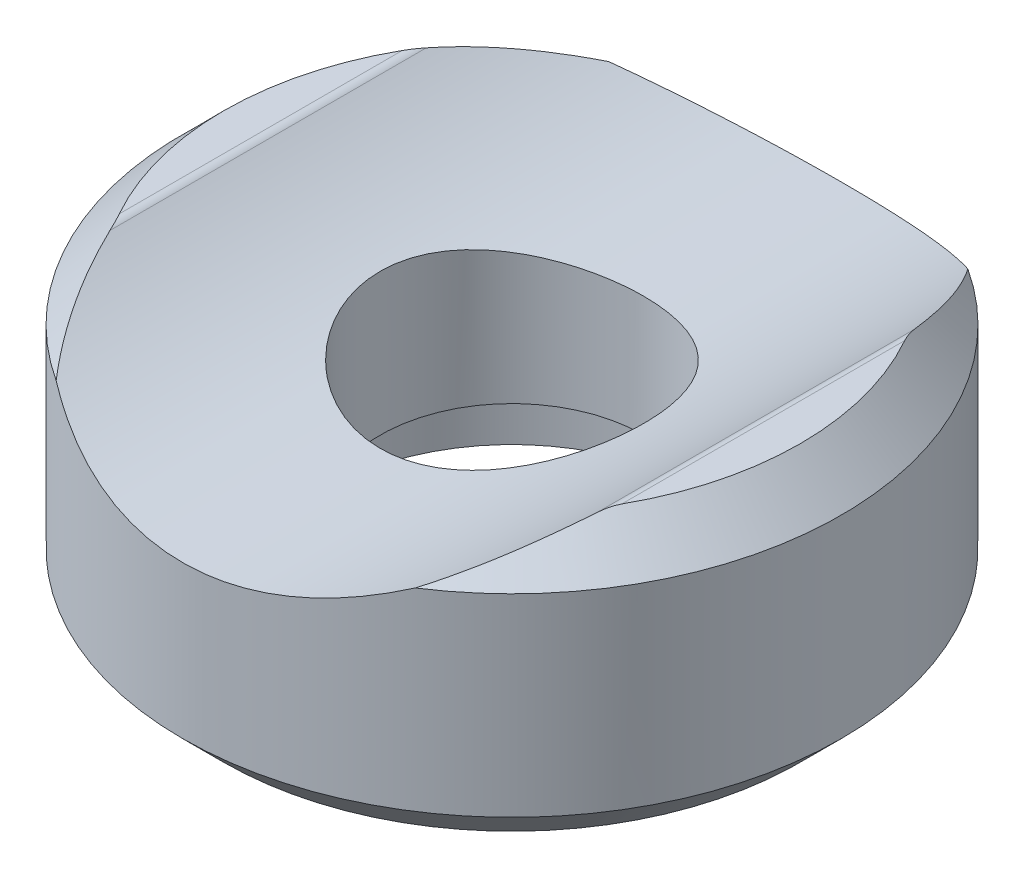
ISO-10303-21;
HEADER;
FILE_DESCRIPTION(('STEP AP214'),'2;1');
FILE_NAME('part.step','',(''),(''),'','','');
FILE_SCHEMA(('AUTOMOTIVE_DESIGN { 1 0 10303 214 1 1 1 1 }'));
ENDSEC;
DATA;
#1=APPLICATION_CONTEXT('core data for automotive mechanical design processes');
#2=APPLICATION_PROTOCOL_DEFINITION('international standard','automotive_design',2000,#1);
#3=PRODUCT_CONTEXT('',#1,'mechanical');
#4=PRODUCT('Part','Part','',(#3));
#5=PRODUCT_RELATED_PRODUCT_CATEGORY('part','',(#4));
#6=PRODUCT_DEFINITION_FORMATION('','',#4);
#7=PRODUCT_DEFINITION_CONTEXT('part definition',#1,'design');
#8=PRODUCT_DEFINITION('design','',#6,#7);
#9=PRODUCT_DEFINITION_SHAPE('','',#8);
#10=(LENGTH_UNIT() NAMED_UNIT(*) SI_UNIT(.MILLI.,.METRE.));
#11=(NAMED_UNIT(*) PLANE_ANGLE_UNIT() SI_UNIT($,.RADIAN.));
#12=(NAMED_UNIT(*) SI_UNIT($,.STERADIAN.) SOLID_ANGLE_UNIT());
#13=UNCERTAINTY_MEASURE_WITH_UNIT(LENGTH_MEASURE(1.E-05),#10,'distance_accuracy_value','');
#14=(GEOMETRIC_REPRESENTATION_CONTEXT(3) GLOBAL_UNCERTAINTY_ASSIGNED_CONTEXT((#13)) GLOBAL_UNIT_ASSIGNED_CONTEXT((#10,
#11,#12)) REPRESENTATION_CONTEXT('',''));
#15=CARTESIAN_POINT('',(0.,0.,0.));
#16=DIRECTION('',(0.,0.,1.));
#17=DIRECTION('',(1.,0.,0.));
#18=AXIS2_PLACEMENT_3D('',#15,#16,#17);
#19=CARTESIAN_POINT('',(0.,0.,0.));
#20=DIRECTION('',(0.,-1.,0.));
#21=DIRECTION('',(0.,0.,-1.));
#22=AXIS2_PLACEMENT_3D('',#19,#20,#21);
#23=CYLINDRICAL_SURFACE('',#22,3.2);
#24=CARTESIAN_POINT('',(-2.26416102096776,4.95969328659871,2.26132148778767));
#25=CARTESIAN_POINT('',(-2.39038548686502,4.98903348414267,2.13493706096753));
#26=CARTESIAN_POINT('',(-2.50600915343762,5.01850310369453,1.99797626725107));
#27=CARTESIAN_POINT('',(-2.7130495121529,5.07446639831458,1.70626814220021));
#28=CARTESIAN_POINT('',(-2.80446511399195,5.10095993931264,1.55152001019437));
#29=CARTESIAN_POINT('',(-2.9605367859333,5.14793687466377,1.22782400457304));
#30=CARTESIAN_POINT('',(-3.025143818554,5.16840923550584,1.05885078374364));
#31=CARTESIAN_POINT('',(-3.12507730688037,5.20070060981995,0.711680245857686));
#32=CARTESIAN_POINT('',(-3.16041430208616,5.21252273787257,0.533486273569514));
#33=CARTESIAN_POINT('',(-3.19974736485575,5.2257172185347,0.179523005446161));
#34=CARTESIAN_POINT('',(-3.20478164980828,5.22743568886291,0.0038818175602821));
#35=CARTESIAN_POINT('',(-3.18608523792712,5.22113110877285,-0.345671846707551));
#36=CARTESIAN_POINT('',(-3.16235679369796,5.21310882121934,-0.519584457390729));
#37=CARTESIAN_POINT('',(-3.08794127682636,5.18863398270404,-0.856565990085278));
#38=CARTESIAN_POINT('',(-3.03790076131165,5.17238394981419,-1.01979368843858));
#39=CARTESIAN_POINT('',(-2.91291355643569,5.1334334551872,-1.33558504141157));
#40=CARTESIAN_POINT('',(-2.837962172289,5.11073177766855,-1.48814667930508));
#41=CARTESIAN_POINT('',(-2.66217099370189,5.0604215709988,-1.78424876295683));
#42=CARTESIAN_POINT('',(-2.56050040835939,5.03266646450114,-1.92727067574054));
#43=CARTESIAN_POINT('',(-2.33535115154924,4.97582411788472,-2.19469942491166));
#44=CARTESIAN_POINT('',(-2.2118667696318,4.94673653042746,-2.31910137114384));
#45=CARTESIAN_POINT('',(-1.94071818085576,4.88911092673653,-2.55081502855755));
#46=CARTESIAN_POINT('',(-1.79228675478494,4.86064095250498,-2.65724861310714));
#47=CARTESIAN_POINT('',(-1.47883374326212,4.80867809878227,-2.84363955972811));
#48=CARTESIAN_POINT('',(-1.31381391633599,4.78518469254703,-2.92359972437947));
#49=CARTESIAN_POINT('',(-0.974231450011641,4.74612497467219,-3.05342762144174));
#50=CARTESIAN_POINT('',(-0.799844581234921,4.73044729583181,-3.10372011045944));
#51=CARTESIAN_POINT('',(-0.444531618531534,4.70830204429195,-3.17414002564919));
#52=CARTESIAN_POINT('',(-0.263607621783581,4.70183154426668,-3.19427703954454));
#53=CARTESIAN_POINT('',(0.0912435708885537,4.69890972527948,-3.20340621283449));
#54=CARTESIAN_POINT('',(0.265134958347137,4.70203719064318,-3.19370768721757));
#55=CARTESIAN_POINT('',(0.608665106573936,4.71706009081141,-3.14636119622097));
#56=CARTESIAN_POINT('',(0.778303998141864,4.72895525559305,-3.1087140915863));
#57=CARTESIAN_POINT('',(1.10749446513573,4.7601491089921,-3.00714769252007));
#58=CARTESIAN_POINT('',(1.26710663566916,4.77939705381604,-2.94340825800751));
#59=CARTESIAN_POINT('',(1.57351405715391,4.82335884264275,-2.79164833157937));
#60=CARTESIAN_POINT('',(1.72030668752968,4.84807380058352,-2.70362289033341));
#61=CARTESIAN_POINT('',(2.0030482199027,4.90156591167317,-2.50182346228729));
#62=CARTESIAN_POINT('',(2.13835675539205,4.93046334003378,-2.38718410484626));
#63=CARTESIAN_POINT('',(2.38823357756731,4.98852077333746,-2.13719209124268));
#64=CARTESIAN_POINT('',(2.50279662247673,5.01768084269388,-2.00183421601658));
#65=CARTESIAN_POINT('',(2.71138285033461,5.07397006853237,-1.70927887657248));
#66=CARTESIAN_POINT('',(2.80467888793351,5.10101097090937,-1.55154413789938));
#67=CARTESIAN_POINT('',(2.96326680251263,5.14877225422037,-1.22168548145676));
#68=CARTESIAN_POINT('',(3.02856528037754,5.16949412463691,-1.04956496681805));
#69=CARTESIAN_POINT('',(3.1275096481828,5.20150847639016,-0.700510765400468));
#70=CARTESIAN_POINT('',(3.16194142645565,5.21303420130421,-0.52382202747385));
#71=CARTESIAN_POINT('',(3.2006838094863,5.2260322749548,-0.166829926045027));
#72=CARTESIAN_POINT('',(3.20500400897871,5.22750782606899,0.0134722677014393));
#73=CARTESIAN_POINT('',(3.18385915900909,5.22038331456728,0.364005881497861));
#74=CARTESIAN_POINT('',(3.15971266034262,5.21222925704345,0.534328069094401));
#75=CARTESIAN_POINT('',(3.08468720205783,5.18757415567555,0.868337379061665));
#76=CARTESIAN_POINT('',(3.03380600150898,5.17107241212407,1.03202394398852));
#77=CARTESIAN_POINT('',(2.90642679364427,5.13145042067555,1.349915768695));
#78=CARTESIAN_POINT('',(2.82970596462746,5.10827286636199,1.504024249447));
#79=CARTESIAN_POINT('',(2.65297049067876,5.05789603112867,1.7975297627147));
#80=CARTESIAN_POINT('',(2.55294971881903,5.03069569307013,1.93692291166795));
#81=CARTESIAN_POINT('',(2.32679026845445,4.97373355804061,2.20411612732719));
#82=CARTESIAN_POINT('',(2.19962844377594,4.94391148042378,2.33103866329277));
#83=CARTESIAN_POINT('',(1.92561954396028,4.8861542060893,2.56205126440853));
#84=CARTESIAN_POINT('',(1.77877002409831,4.85821924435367,2.66613848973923));
#85=CARTESIAN_POINT('',(1.46678412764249,4.80687811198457,2.84987317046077));
#86=CARTESIAN_POINT('',(1.30141328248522,4.78354355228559,2.92914400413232));
#87=CARTESIAN_POINT('',(0.958770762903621,4.7445776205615,3.05847389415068));
#88=CARTESIAN_POINT('',(0.781502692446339,4.72894392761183,3.10854175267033));
#89=CARTESIAN_POINT('',(0.427256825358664,4.70761581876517,3.17627711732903));
#90=CARTESIAN_POINT('',(0.250520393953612,4.70156867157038,3.19509574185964));
#91=CARTESIAN_POINT('',(-0.103683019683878,4.6989703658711,3.20321956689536));
#92=CARTESIAN_POINT('',(-0.281149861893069,4.70241746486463,3.19253018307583));
#93=CARTESIAN_POINT('',(-0.62608659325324,4.71816942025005,3.14284274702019));
#94=CARTESIAN_POINT('',(-0.793696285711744,4.73020074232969,3.10471858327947));
#95=CARTESIAN_POINT('',(-1.12004492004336,4.76156993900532,3.00245708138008));
#96=CARTESIAN_POINT('',(-1.27878308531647,4.78090845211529,2.93831746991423));
#97=CARTESIAN_POINT('',(-1.58535989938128,4.82523670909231,2.78502856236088));
#98=CARTESIAN_POINT('',(-1.73303488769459,4.85029497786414,2.69557256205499));
#99=CARTESIAN_POINT('',(-2.01179236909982,4.90342626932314,2.49444370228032));
#100=CARTESIAN_POINT('',(-2.14287079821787,4.93150002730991,2.38276541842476));
#101=CARTESIAN_POINT('',(-2.26416102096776,4.95969328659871,2.26132148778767));
#102=B_SPLINE_CURVE_WITH_KNOTS('',3,(#24,#25,#26,#27,#28,#29,#30,#31,#32,#33,#34,#35,#36,#37,
#38,#39,#40,#41,#42,#43,#44,#45,#46,#47,#48,#49,#50,#51,#52,#53,#54,#55,#56,#57,#58,#59,#60,#61,
#62,#63,#64,#65,#66,#67,#68,#69,#70,#71,#72,#73,#74,#75,#76,#77,#78,#79,#80,#81,#82,#83,#84,#85,
#86,#87,#88,#89,#90,#91,#92,#93,#94,#95,#96,#97,#98,#99,#100,#101),.UNSPECIFIED.,.T.,.F.,(4,2,2,
2,2,2,2,2,2,2,2,2,2,2,2,2,2,2,2,2,2,2,2,2,2,2,2,2,2,2,2,2,2,2,2,2,2,2,4),(0.,0.542449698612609,
1.08492382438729,1.62838590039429,2.17165220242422,2.69619432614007,3.22069537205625,
3.73287203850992,4.24514528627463,4.77575907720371,5.30651197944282,5.85840610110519,
6.41024177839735,6.95397190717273,7.49752912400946,8.01757809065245,8.53761104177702,
9.05411809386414,9.57073048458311,10.1073558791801,10.6441166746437,11.1971336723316,
11.7500202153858,12.288393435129,12.826595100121,13.340816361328,13.8550807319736,
14.3738983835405,14.892852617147,15.4367145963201,15.9806441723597,16.5324678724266,
17.0841251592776,17.6149698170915,18.1457170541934,18.6602667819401,19.1748614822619,
19.6959789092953,20.2172236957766),.UNSPECIFIED.);
#103=CARTESIAN_POINT('',(-2.26416102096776,4.95969328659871,2.26132148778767));
#104=VERTEX_POINT('',#103);
#105=EDGE_CURVE('E87',#104,#104,#102,.F.);
#106=ORIENTED_EDGE('',*,*,#105,.T.);
#107=EDGE_LOOP('',(#106));
#108=FACE_BOUND('',#107,.T.);
#109=CARTESIAN_POINT('',(0.,1.78111880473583,0.));
#110=DIRECTION('',(0.,-1.,0.));
#111=DIRECTION('',(0.,0.,-1.));
#112=AXIS2_PLACEMENT_3D('',#109,#110,#111);
#113=CIRCLE('',#112,3.2);
#114=CARTESIAN_POINT('',(0.,1.78111880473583,-3.2));
#115=VERTEX_POINT('',#114);
#116=EDGE_CURVE('E171',#115,#115,#113,.T.);
#117=ORIENTED_EDGE('',*,*,#116,.T.);
#118=EDGE_LOOP('',(#117));
#119=FACE_BOUND('',#118,.T.);
#120=ADVANCED_FACE('F14',(#108,#119),#23,.F.);
#121=CARTESIAN_POINT('',(0.,0.999999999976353,0.));
#122=DIRECTION('',(0.,-1.,0.));
#123=DIRECTION('',(0.,0.,-1.));
#124=AXIS2_PLACEMENT_3D('',#121,#122,#123);
#125=CONICAL_SURFACE('',#124,4.50000000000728,1.02974425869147);
#126=ORIENTED_EDGE('',*,*,#116,.F.);
#127=EDGE_LOOP('',(#126));
#128=FACE_BOUND('',#127,.T.);
#129=CARTESIAN_POINT('',(0.,1.,0.));
#130=DIRECTION('',(0.,-1.,0.));
#131=DIRECTION('',(0.,0.,-1.));
#132=AXIS2_PLACEMENT_3D('',#129,#130,#131);
#133=CIRCLE('',#132,4.5);
#134=CARTESIAN_POINT('',(0.,1.,-4.5));
#135=VERTEX_POINT('',#134);
#136=EDGE_CURVE('E169',#135,#135,#133,.T.);
#137=ORIENTED_EDGE('',*,*,#136,.T.);
#138=EDGE_LOOP('',(#137));
#139=FACE_BOUND('',#138,.T.);
#140=ADVANCED_FACE('F227',(#128,#139),#125,.F.);
#141=CARTESIAN_POINT('',(0.,0.,0.));
#142=DIRECTION('',(0.,-1.,0.));
#143=DIRECTION('',(0.,0.,-1.));
#144=AXIS2_PLACEMENT_3D('',#141,#142,#143);
#145=CYLINDRICAL_SURFACE('',#144,4.5);
#146=ORIENTED_EDGE('',*,*,#136,.F.);
#147=EDGE_LOOP('',(#146));
#148=FACE_BOUND('',#147,.T.);
#149=CARTESIAN_POINT('',(0.,0.,0.));
#150=DIRECTION('',(0.,-1.,0.));
#151=DIRECTION('',(0.,0.,-1.));
#152=AXIS2_PLACEMENT_3D('',#149,#150,#151);
#153=CIRCLE('',#152,4.5);
#154=CARTESIAN_POINT('',(0.,0.,-4.5));
#155=VERTEX_POINT('',#154);
#156=EDGE_CURVE('E83',#155,#155,#153,.F.);
#157=ORIENTED_EDGE('',*,*,#156,.F.);
#158=EDGE_LOOP('',(#157));
#159=FACE_BOUND('',#158,.T.);
#160=ADVANCED_FACE('F225',(#148,#159),#145,.F.);
#161=CARTESIAN_POINT('',(7.,6.7,0.));
#162=DIRECTION('',(0.,1.,0.));
#163=DIRECTION('',(0.,0.,1.));
#164=AXIS2_PLACEMENT_3D('',#161,#162,#163);
#165=PLANE('',#164);
#166=CARTESIAN_POINT('',(0.,6.7,0.));
#167=DIRECTION('',(0.,-1.,0.));
#168=DIRECTION('',(0.,0.,-1.));
#169=AXIS2_PLACEMENT_3D('',#166,#167,#168);
#170=CIRCLE('',#169,7.);
#171=CARTESIAN_POINT('',(6.09918027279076,6.7,-3.43511280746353));
#172=VERTEX_POINT('',#171);
#173=CARTESIAN_POINT('',(6.09918027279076,6.7,3.43511280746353));
#174=VERTEX_POINT('',#173);
#175=EDGE_CURVE('E217',#172,#174,#170,.T.);
#176=ORIENTED_EDGE('',*,*,#175,.F.);
#177=DIRECTION('',(0.,0.,-1.));
#178=VECTOR('',#177,1.);
#179=CARTESIAN_POINT('',(6.09918027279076,6.7,9.));
#180=LINE('',#179,#178);
#181=EDGE_CURVE('E78',#174,#172,#180,.T.);
#182=ORIENTED_EDGE('',*,*,#181,.F.);
#183=EDGE_LOOP('',(#176,#182));
#184=FACE_BOUND('',#183,.T.);
#185=ADVANCED_FACE('F198',(#184),#165,.T.);
#186=CARTESIAN_POINT('',(6.09918027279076,6.4,9.));
#187=DIRECTION('',(0.,0.,-1.));
#188=DIRECTION('',(-1.,0.,0.));
#189=AXIS2_PLACEMENT_3D('',#186,#187,#188);
#190=CYLINDRICAL_SURFACE('',#189,0.299999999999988);
#191=CARTESIAN_POINT('',(5.92153424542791,6.64174757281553,-3.84114039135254));
#192=CARTESIAN_POINT('',(5.93345662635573,6.65047655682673,-3.80672287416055));
#193=CARTESIAN_POINT('',(5.94602793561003,6.65838972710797,-3.77231180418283));
#194=CARTESIAN_POINT('',(5.97249602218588,6.67235639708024,-3.70382967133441));
#195=CARTESIAN_POINT('',(5.98638585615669,6.67841899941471,-3.66975776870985));
#196=CARTESIAN_POINT('',(6.01564192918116,6.68854964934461,-3.60192002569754));
#197=CARTESIAN_POINT('',(6.03100876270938,6.69261688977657,-3.56815431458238));
#198=CARTESIAN_POINT('',(6.05541279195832,6.69690580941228,-3.51790439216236));
#199=CARTESIAN_POINT('',(6.06379594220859,6.69803399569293,-3.50117922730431));
#200=CARTESIAN_POINT('',(6.08108139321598,6.69957753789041,-3.46795538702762));
#201=CARTESIAN_POINT('',(6.08998398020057,6.69999249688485,-3.45145684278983));
#202=CARTESIAN_POINT('',(6.09918027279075,6.7,-3.43511280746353));
#203=B_SPLINE_CURVE_WITH_KNOTS('',3,(#191,#192,#193,#194,#195,#196,#197,#198,#199,#200,#201,
#202),.UNSPECIFIED.,.F.,.F.,(4,2,2,2,2,4),(0.,0.112365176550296,0.224168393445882,
0.336016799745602,0.392224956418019,0.448464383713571),.UNSPECIFIED.);
#204=CARTESIAN_POINT('',(5.92153424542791,6.64174757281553,-3.84114039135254));
#205=VERTEX_POINT('',#204);
#206=EDGE_CURVE('E210',#205,#172,#203,.T.);
#207=ORIENTED_EDGE('',*,*,#206,.F.);
#208=DIRECTION('',(0.,0.,-1.));
#209=VECTOR('',#208,1.);
#210=CARTESIAN_POINT('',(5.92153424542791,6.64174757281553,9.));
#211=LINE('',#210,#209);
#212=CARTESIAN_POINT('',(5.92153424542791,6.64174757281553,3.84114039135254));
#213=VERTEX_POINT('',#212);
#214=EDGE_CURVE('E250',#205,#213,#211,.F.);
#215=ORIENTED_EDGE('',*,*,#214,.T.);
#216=CARTESIAN_POINT('',(6.09918027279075,6.7,3.43511280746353));
#217=CARTESIAN_POINT('',(6.08998398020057,6.69999249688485,3.45145684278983));
#218=CARTESIAN_POINT('',(6.08108139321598,6.69957753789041,3.46795538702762));
#219=CARTESIAN_POINT('',(6.06379594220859,6.69803399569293,3.50117922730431));
#220=CARTESIAN_POINT('',(6.05541279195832,6.69690580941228,3.51790439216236));
#221=CARTESIAN_POINT('',(6.03100876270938,6.69261688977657,3.56815431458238));
#222=CARTESIAN_POINT('',(6.01564192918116,6.68854964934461,3.60192002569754));
#223=CARTESIAN_POINT('',(5.98638585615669,6.67841899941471,3.66975776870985));
#224=CARTESIAN_POINT('',(5.97249602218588,6.67235639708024,3.70382967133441));
#225=CARTESIAN_POINT('',(5.94602793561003,6.65838972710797,3.77231180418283));
#226=CARTESIAN_POINT('',(5.93345662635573,6.65047655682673,3.80672287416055));
#227=CARTESIAN_POINT('',(5.92153424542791,6.64174757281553,3.84114039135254));
#228=B_SPLINE_CURVE_WITH_KNOTS('',3,(#216,#217,#218,#219,#220,#221,#222,#223,#224,#225,#226,
#227),.UNSPECIFIED.,.F.,.F.,(4,2,2,2,2,4),(0.,0.0562394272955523,0.112447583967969,
0.224295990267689,0.336099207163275,0.448464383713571),.UNSPECIFIED.);
#229=EDGE_CURVE('E203',#174,#213,#228,.T.);
#230=ORIENTED_EDGE('',*,*,#229,.F.);
#231=ORIENTED_EDGE('',*,*,#181,.T.);
#232=EDGE_LOOP('',(#207,#215,#230,#231));
#233=FACE_BOUND('',#232,.T.);
#234=ADVANCED_FACE('F193',(#233),#190,.T.);
#235=CARTESIAN_POINT('',(-6.09918027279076,6.4,9.));
#236=DIRECTION('',(0.,0.,-1.));
#237=DIRECTION('',(-1.,0.,0.));
#238=AXIS2_PLACEMENT_3D('',#235,#236,#237);
#239=CYLINDRICAL_SURFACE('',#238,0.3);
#240=CARTESIAN_POINT('',(-6.09918027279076,6.7,3.43511280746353));
#241=CARTESIAN_POINT('',(-6.08998398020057,6.69999249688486,3.45145684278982));
#242=CARTESIAN_POINT('',(-6.08108139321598,6.69957753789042,3.46795538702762));
#243=CARTESIAN_POINT('',(-6.06379594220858,6.69803399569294,3.5011792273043));
#244=CARTESIAN_POINT('',(-6.05541279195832,6.69690580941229,3.51790439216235));
#245=CARTESIAN_POINT('',(-6.03100876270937,6.69261688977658,3.56815431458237));
#246=CARTESIAN_POINT('',(-6.01564192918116,6.68854964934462,3.60192002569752));
#247=CARTESIAN_POINT('',(-5.98638585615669,6.67841899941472,3.66975776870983));
#248=CARTESIAN_POINT('',(-5.97249602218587,6.67235639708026,3.70382967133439));
#249=CARTESIAN_POINT('',(-5.94602793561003,6.65838972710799,3.77231180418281));
#250=CARTESIAN_POINT('',(-5.93345662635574,6.65047655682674,3.80672287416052));
#251=CARTESIAN_POINT('',(-5.92153424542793,6.64174757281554,3.84114039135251));
#252=B_SPLINE_CURVE_WITH_KNOTS('',3,(#240,#241,#242,#243,#244,#245,#246,#247,#248,#249,#250,
#251),.UNSPECIFIED.,.F.,.F.,(4,2,2,2,2,4),(0.,0.0562394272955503,0.112447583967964,
0.224295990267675,0.336099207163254,0.448464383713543),.UNSPECIFIED.);
#253=CARTESIAN_POINT('',(-6.09918027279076,6.7,3.43511280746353));
#254=VERTEX_POINT('',#253);
#255=CARTESIAN_POINT('',(-5.92153424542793,6.64174757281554,3.8411403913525));
#256=VERTEX_POINT('',#255);
#257=EDGE_CURVE('E77',#254,#256,#252,.T.);
#258=ORIENTED_EDGE('',*,*,#257,.T.);
#259=DIRECTION('',(0.,0.,-1.));
#260=VECTOR('',#259,1.);
#261=CARTESIAN_POINT('',(-5.92153424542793,6.64174757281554,9.));
#262=LINE('',#261,#260);
#263=CARTESIAN_POINT('',(-5.92153424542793,6.64174757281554,-3.8411403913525));
#264=VERTEX_POINT('',#263);
#265=EDGE_CURVE('E75',#256,#264,#262,.T.);
#266=ORIENTED_EDGE('',*,*,#265,.T.);
#267=CARTESIAN_POINT('',(-5.92153424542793,6.64174757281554,-3.84114039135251));
#268=CARTESIAN_POINT('',(-5.93345662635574,6.65047655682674,-3.80672287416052));
#269=CARTESIAN_POINT('',(-5.94602793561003,6.65838972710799,-3.7723118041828));
#270=CARTESIAN_POINT('',(-5.97249602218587,6.67235639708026,-3.70382967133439));
#271=CARTESIAN_POINT('',(-5.98638585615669,6.67841899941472,-3.66975776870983));
#272=CARTESIAN_POINT('',(-6.01564192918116,6.68854964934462,-3.60192002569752));
#273=CARTESIAN_POINT('',(-6.03100876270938,6.69261688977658,-3.56815431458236));
#274=CARTESIAN_POINT('',(-6.05541279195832,6.69690580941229,-3.51790439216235));
#275=CARTESIAN_POINT('',(-6.06379594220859,6.69803399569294,-3.5011792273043));
#276=CARTESIAN_POINT('',(-6.08108139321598,6.69957753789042,-3.46795538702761));
#277=CARTESIAN_POINT('',(-6.08998398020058,6.69999249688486,-3.45145684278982));
#278=CARTESIAN_POINT('',(-6.09918027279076,6.7,-3.43511280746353));
#279=B_SPLINE_CURVE_WITH_KNOTS('',3,(#267,#268,#269,#270,#271,#272,#273,#274,#275,#276,#277,
#278),.UNSPECIFIED.,.F.,.F.,(4,2,2,2,2,4),(0.,0.11236517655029,0.22416839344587,
0.336016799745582,0.392224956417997,0.448464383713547),.UNSPECIFIED.);
#280=CARTESIAN_POINT('',(-6.09918027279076,6.7,-3.43511280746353));
#281=VERTEX_POINT('',#280);
#282=EDGE_CURVE('E67',#264,#281,#279,.T.);
#283=ORIENTED_EDGE('',*,*,#282,.T.);
#284=DIRECTION('',(0.,0.,1.));
#285=VECTOR('',#284,1.);
#286=CARTESIAN_POINT('',(-6.09918027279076,6.7,0.));
#287=LINE('',#286,#285);
#288=EDGE_CURVE('E73',#254,#281,#287,.F.);
#289=ORIENTED_EDGE('',*,*,#288,.F.);
#290=EDGE_LOOP('',(#258,#266,#283,#289));
#291=FACE_BOUND('',#290,.T.);
#292=ADVANCED_FACE('F72',(#291),#239,.T.);
#293=CARTESIAN_POINT('',(7.,6.7,0.));
#294=DIRECTION('',(0.,1.,0.));
#295=DIRECTION('',(0.,0.,1.));
#296=AXIS2_PLACEMENT_3D('',#293,#294,#295);
#297=PLANE('',#296);
#298=ORIENTED_EDGE('',*,*,#288,.T.);
#299=CARTESIAN_POINT('',(0.,6.7,0.));
#300=DIRECTION('',(0.,-1.,0.));
#301=DIRECTION('',(0.,0.,-1.));
#302=AXIS2_PLACEMENT_3D('',#299,#300,#301);
#303=CIRCLE('',#302,7.);
#304=EDGE_CURVE('E82',#254,#281,#303,.T.);
#305=ORIENTED_EDGE('',*,*,#304,.F.);
#306=EDGE_LOOP('',(#298,#305));
#307=FACE_BOUND('',#306,.T.);
#308=ADVANCED_FACE('F81',(#307),#297,.T.);
#309=CARTESIAN_POINT('',(4.5,0.,0.));
#310=DIRECTION('',(0.,-1.,0.));
#311=DIRECTION('',(0.,0.,-1.));
#312=AXIS2_PLACEMENT_3D('',#309,#310,#311);
#313=PLANE('',#312);
#314=ORIENTED_EDGE('',*,*,#156,.T.);
#315=EDGE_LOOP('',(#314));
#316=FACE_BOUND('',#315,.T.);
#317=CARTESIAN_POINT('',(0.,0.,0.));
#318=DIRECTION('',(0.,1.,0.));
#319=DIRECTION('',(0.,0.,1.));
#320=AXIS2_PLACEMENT_3D('',#317,#318,#319);
#321=CIRCLE('',#320,7.);
#322=CARTESIAN_POINT('',(0.,0.,7.));
#323=VERTEX_POINT('',#322);
#324=EDGE_CURVE('E152',#323,#323,#321,.T.);
#325=ORIENTED_EDGE('',*,*,#324,.F.);
#326=EDGE_LOOP('',(#325));
#327=FACE_BOUND('',#326,.T.);
#328=ADVANCED_FACE('F222',(#316,#327),#313,.T.);
#329=CARTESIAN_POINT('',(0.,5.7,0.));
#330=DIRECTION('',(0.,-1.,0.));
#331=DIRECTION('',(0.,0.,-1.));
#332=AXIS2_PLACEMENT_3D('',#329,#330,#331);
#333=CONICAL_SURFACE('',#332,8.,0.785398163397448);
#334=ORIENTED_EDGE('',*,*,#229,.T.);
#335=CARTESIAN_POINT('',(5.92153424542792,6.64174757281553,3.84114039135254));
#336=CARTESIAN_POINT('',(5.83068998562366,6.57504209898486,4.10365441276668));
#337=CARTESIAN_POINT('',(5.73022677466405,6.50353168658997,4.36162611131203));
#338=CARTESIAN_POINT('',(5.51031029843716,6.35408867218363,4.8650272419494));
#339=CARTESIAN_POINT('',(5.39099933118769,6.27620614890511,5.11053376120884));
#340=CARTESIAN_POINT('',(5.13241528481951,6.1162148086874,5.58924070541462));
#341=CARTESIAN_POINT('',(4.99315409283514,6.03410852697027,5.8224483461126));
#342=CARTESIAN_POINT('',(4.76811614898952,5.90952266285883,6.16226455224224));
#343=CARTESIAN_POINT('',(4.69009525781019,5.86759938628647,6.27426416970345));
#344=CARTESIAN_POINT('',(4.52861256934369,5.78372669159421,6.49429707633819));
#345=CARTESIAN_POINT('',(4.44514960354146,5.74177726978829,6.6023295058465));
#346=CARTESIAN_POINT('',(4.35889894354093,5.70000000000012,6.70820393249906));
#347=B_SPLINE_CURVE_WITH_KNOTS('',3,(#335,#336,#337,#338,#339,#340,#341,#342,#343,#344,#345,
#346),.UNSPECIFIED.,.F.,.F.,(4,2,2,2,2,4),(0.,0.856819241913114,1.70745422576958,
2.55758445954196,2.9858126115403,3.41413301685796),.UNSPECIFIED.);
#348=CARTESIAN_POINT('',(4.35889894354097,5.70000000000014,6.7082039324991));
#349=VERTEX_POINT('',#348);
#350=EDGE_CURVE('E122',#213,#349,#347,.T.);
#351=ORIENTED_EDGE('',*,*,#350,.T.);
#352=CARTESIAN_POINT('',(0.,5.70000000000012,0.));
#353=DIRECTION('',(0.,-1.,0.));
#354=DIRECTION('',(0.,0.,-1.));
#355=AXIS2_PLACEMENT_3D('',#352,#353,#354);
#356=CIRCLE('',#355,8.);
#357=CARTESIAN_POINT('',(4.35889894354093,5.70000000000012,-6.70820393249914));
#358=VERTEX_POINT('',#357);
#359=EDGE_CURVE('E158',#358,#349,#356,.T.);
#360=ORIENTED_EDGE('',*,*,#359,.F.);
#361=CARTESIAN_POINT('',(4.35889894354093,5.70000000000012,-6.70820393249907));
#362=CARTESIAN_POINT('',(4.44514960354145,5.74177726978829,-6.6023295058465));
#363=CARTESIAN_POINT('',(4.52861256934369,5.78372669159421,-6.49429707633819));
#364=CARTESIAN_POINT('',(4.69009525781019,5.86759938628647,-6.27426416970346));
#365=CARTESIAN_POINT('',(4.76811614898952,5.90952266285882,-6.16226455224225));
#366=CARTESIAN_POINT('',(4.99315409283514,6.03410852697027,-5.82244834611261));
#367=CARTESIAN_POINT('',(5.13241528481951,6.1162148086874,-5.58924070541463));
#368=CARTESIAN_POINT('',(5.39099933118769,6.27620614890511,-5.11053376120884));
#369=CARTESIAN_POINT('',(5.51031029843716,6.35408867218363,-4.8650272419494));
#370=CARTESIAN_POINT('',(5.73022677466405,6.50353168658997,-4.36162611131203));
#371=CARTESIAN_POINT('',(5.83068998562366,6.57504209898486,-4.10365441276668));
#372=CARTESIAN_POINT('',(5.92153424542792,6.64174757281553,-3.84114039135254));
#373=B_SPLINE_CURVE_WITH_KNOTS('',3,(#361,#362,#363,#364,#365,#366,#367,#368,#369,#370,#371,
#372),.UNSPECIFIED.,.F.,.F.,(4,2,2,2,2,4),(0.,0.428320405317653,0.856548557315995,
1.70667879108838,2.55731377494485,3.41413301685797),.UNSPECIFIED.);
#374=EDGE_CURVE('E91',#358,#205,#373,.T.);
#375=ORIENTED_EDGE('',*,*,#374,.T.);
#376=ORIENTED_EDGE('',*,*,#206,.T.);
#377=ORIENTED_EDGE('',*,*,#175,.T.);
#378=EDGE_LOOP('',(#334,#351,#360,#375,#376,#377));
#379=FACE_BOUND('',#378,.T.);
#380=ADVANCED_FACE('F113',(#379),#333,.T.);
#381=CARTESIAN_POINT('',(0.,14.7,9.));
#382=DIRECTION('',(0.,0.,-1.));
#383=DIRECTION('',(-1.,0.,0.));
#384=AXIS2_PLACEMENT_3D('',#381,#382,#383);
#385=CYLINDRICAL_SURFACE('',#384,10.);
#386=ORIENTED_EDGE('',*,*,#105,.F.);
#387=EDGE_LOOP('',(#386));
#388=FACE_BOUND('',#387,.T.);
#389=CARTESIAN_POINT('',(-4.35889894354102,5.70000000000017,-6.70820393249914));
#390=CARTESIAN_POINT('',(-4.20490551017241,5.62540226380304,-6.8082734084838));
#391=CARTESIAN_POINT('',(-4.04646441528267,5.55356087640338,-6.90367701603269));
#392=CARTESIAN_POINT('',(-3.72102635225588,5.41640691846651,-7.08439244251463));
#393=CARTESIAN_POINT('',(-3.55402199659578,5.35110013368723,-7.16969533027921));
#394=CARTESIAN_POINT('',(-3.21111861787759,5.2278246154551,-7.32971408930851));
#395=CARTESIAN_POINT('',(-3.03517531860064,5.16989868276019,-7.40436848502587));
#396=CARTESIAN_POINT('',(-2.67606872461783,5.06289777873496,-7.54159055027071));
#397=CARTESIAN_POINT('',(-2.49290734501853,5.01382047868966,-7.60416140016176));
#398=CARTESIAN_POINT('',(-2.1192764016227,4.92525040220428,-7.71666632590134));
#399=CARTESIAN_POINT('',(-1.92877143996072,4.88581325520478,-7.76652712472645));
#400=CARTESIAN_POINT('',(-1.54272257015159,4.8177726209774,-7.85233100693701));
#401=CARTESIAN_POINT('',(-1.3471782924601,4.78916993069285,-7.88827306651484));
#402=CARTESIAN_POINT('',(-0.953234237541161,4.7435679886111,-7.94549157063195));
#403=CARTESIAN_POINT('',(-0.754845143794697,4.72653317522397,-7.9668129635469));
#404=CARTESIAN_POINT('',(-0.356376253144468,4.70436101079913,-7.99455248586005));
#405=CARTESIAN_POINT('',(-0.156296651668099,4.69922230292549,-8.00097231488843));
#406=CARTESIAN_POINT('',(0.225010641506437,4.70088708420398,-7.99889096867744));
#407=CARTESIAN_POINT('',(0.406252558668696,4.70661932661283,-7.99172825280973));
#408=CARTESIAN_POINT('',(0.76726480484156,4.7278389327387,-7.96517799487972));
#409=CARTESIAN_POINT('',(0.947035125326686,4.74332635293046,-7.94579038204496));
#410=CARTESIAN_POINT('',(1.3040075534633,4.78375723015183,-7.89506839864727));
#411=CARTESIAN_POINT('',(1.48120649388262,4.80871146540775,-7.86372041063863));
#412=CARTESIAN_POINT('',(1.8316563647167,4.8675733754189,-7.78955208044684));
#413=CARTESIAN_POINT('',(2.00490729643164,4.90148104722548,-7.74673174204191));
#414=CARTESIAN_POINT('',(2.34510339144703,4.97731486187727,-7.65058650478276));
#415=CARTESIAN_POINT('',(2.51208796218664,5.01917456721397,-7.59734853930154));
#416=CARTESIAN_POINT('',(2.8404212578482,5.11036500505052,-7.48080270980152));
#417=CARTESIAN_POINT('',(3.00176759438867,5.15969885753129,-7.41749063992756));
#418=CARTESIAN_POINT('',(3.47592945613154,5.31764825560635,-7.21359581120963));
#419=CARTESIAN_POINT('',(3.77957159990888,5.43637331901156,-7.05885186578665));
#420=CARTESIAN_POINT('',(4.11783140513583,5.58702039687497,-6.85906375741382));
#421=CARTESIAN_POINT('',(4.16665549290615,5.60924391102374,-6.82951227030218));
#422=CARTESIAN_POINT('',(4.26341959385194,5.65422295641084,-6.76952571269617));
#423=CARTESIAN_POINT('',(4.31136055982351,5.67697784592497,-6.73909169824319));
#424=CARTESIAN_POINT('',(4.35889894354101,5.70000000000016,-6.70820393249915));
#425=B_SPLINE_CURVE_WITH_KNOTS('',3,(#389,#390,#391,#392,#393,#394,#395,#396,#397,#398,#399,
#400,#401,#402,#403,#404,#405,#406,#407,#408,#409,#410,#411,#412,#413,#414,#415,#416,#417,#418,
#419,#420,#421,#422,#423,#424),.UNSPECIFIED.,.F.,.F.,(4,2,2,2,2,2,2,2,2,2,2,2,2,2,2,2,2,4),(0.,
0.594641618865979,1.18980516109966,1.78827650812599,2.38659012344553,2.98827891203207,
3.59001195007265,4.18988668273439,4.78969299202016,5.33344061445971,5.87719138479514,
6.42156309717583,6.9659346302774,7.50594358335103,8.04617858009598,9.12441942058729,
9.30815725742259,9.49168363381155),.UNSPECIFIED.);
#426=CARTESIAN_POINT('',(-4.35889894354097,5.70000000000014,-6.7082039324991));
#427=VERTEX_POINT('',#426);
#428=EDGE_CURVE('E140',#427,#358,#425,.T.);
#429=ORIENTED_EDGE('',*,*,#428,.F.);
#430=CARTESIAN_POINT('',(-5.92153424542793,6.64174757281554,-3.84114039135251));
#431=CARTESIAN_POINT('',(-5.83068998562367,6.57504209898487,-4.10365441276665));
#432=CARTESIAN_POINT('',(-5.73022677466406,6.50353168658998,-4.361626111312));
#433=CARTESIAN_POINT('',(-5.51031029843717,6.35408867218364,-4.86502724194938));
#434=CARTESIAN_POINT('',(-5.3909993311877,6.27620614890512,-5.11053376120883));
#435=CARTESIAN_POINT('',(-5.13241528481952,6.11621480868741,-5.58924070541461));
#436=CARTESIAN_POINT('',(-4.99315409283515,6.03410852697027,-5.82244834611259));
#437=CARTESIAN_POINT('',(-4.76811614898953,5.90952266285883,-6.16226455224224));
#438=CARTESIAN_POINT('',(-4.6900952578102,5.86759938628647,-6.27426416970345));
#439=CARTESIAN_POINT('',(-4.5286125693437,5.78372669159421,-6.49429707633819));
#440=CARTESIAN_POINT('',(-4.44514960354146,5.74177726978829,-6.60232950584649));
#441=CARTESIAN_POINT('',(-4.35889894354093,5.70000000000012,-6.70820393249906));
#442=B_SPLINE_CURVE_WITH_KNOTS('',3,(#430,#431,#432,#433,#434,#435,#436,#437,#438,#439,#440,
#441),.UNSPECIFIED.,.F.,.F.,(4,2,2,2,2,4),(0.,0.856819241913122,1.7074542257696,
2.55758445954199,2.98581261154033,3.41413301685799),.UNSPECIFIED.);
#443=EDGE_CURVE('E86',#264,#427,#442,.T.);
#444=ORIENTED_EDGE('',*,*,#443,.F.);
#445=ORIENTED_EDGE('',*,*,#265,.F.);
#446=CARTESIAN_POINT('',(-4.35889894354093,5.70000000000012,6.70820393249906));
#447=CARTESIAN_POINT('',(-4.44514960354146,5.74177726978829,6.60232950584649));
#448=CARTESIAN_POINT('',(-4.5286125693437,5.78372669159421,6.49429707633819));
#449=CARTESIAN_POINT('',(-4.6900952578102,5.86759938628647,6.27426416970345));
#450=CARTESIAN_POINT('',(-4.76811614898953,5.90952266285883,6.16226455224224));
#451=CARTESIAN_POINT('',(-4.99315409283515,6.03410852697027,5.8224483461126));
#452=CARTESIAN_POINT('',(-5.13241528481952,6.1162148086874,5.58924070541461));
#453=CARTESIAN_POINT('',(-5.3909993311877,6.27620614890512,5.11053376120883));
#454=CARTESIAN_POINT('',(-5.51031029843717,6.35408867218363,4.86502724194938));
#455=CARTESIAN_POINT('',(-5.73022677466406,6.50353168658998,4.361626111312));
#456=CARTESIAN_POINT('',(-5.83068998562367,6.57504209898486,4.10365441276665));
#457=CARTESIAN_POINT('',(-5.92153424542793,6.64174757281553,3.84114039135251));
#458=B_SPLINE_CURVE_WITH_KNOTS('',3,(#446,#447,#448,#449,#450,#451,#452,#453,#454,#455,#456,
#457),.UNSPECIFIED.,.F.,.F.,(4,2,2,2,2,4),(0.,0.428320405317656,0.856548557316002,
1.70667879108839,2.55731377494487,3.41413301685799),.UNSPECIFIED.);
#459=CARTESIAN_POINT('',(-4.35889894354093,5.70000000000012,6.70820393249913));
#460=VERTEX_POINT('',#459);
#461=EDGE_CURVE('E33',#460,#256,#458,.T.);
#462=ORIENTED_EDGE('',*,*,#461,.F.);
#463=CARTESIAN_POINT('',(4.35889894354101,5.70000000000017,6.70820393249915));
#464=CARTESIAN_POINT('',(4.2049055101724,5.62540226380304,6.80827340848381));
#465=CARTESIAN_POINT('',(4.04646441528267,5.55356087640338,6.90367701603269));
#466=CARTESIAN_POINT('',(3.72102635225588,5.4164069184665,7.08439244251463));
#467=CARTESIAN_POINT('',(3.55402199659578,5.35110013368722,7.16969533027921));
#468=CARTESIAN_POINT('',(3.21111861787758,5.22782461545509,7.32971408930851));
#469=CARTESIAN_POINT('',(3.03517531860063,5.16989868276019,7.40436848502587));
#470=CARTESIAN_POINT('',(2.67606872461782,5.06289777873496,7.54159055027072));
#471=CARTESIAN_POINT('',(2.49290734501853,5.01382047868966,7.60416140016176));
#472=CARTESIAN_POINT('',(2.1192764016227,4.92525040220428,7.71666632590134));
#473=CARTESIAN_POINT('',(1.92877143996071,4.88581325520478,7.76652712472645));
#474=CARTESIAN_POINT('',(1.54272257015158,4.8177726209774,7.85233100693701));
#475=CARTESIAN_POINT('',(1.3471782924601,4.78916993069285,7.88827306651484));
#476=CARTESIAN_POINT('',(0.953234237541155,4.7435679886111,7.94549157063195));
#477=CARTESIAN_POINT('',(0.754845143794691,4.72653317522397,7.9668129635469));
#478=CARTESIAN_POINT('',(0.356376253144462,4.70436101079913,7.99455248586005));
#479=CARTESIAN_POINT('',(0.156296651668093,4.69922230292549,8.00097231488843));
#480=CARTESIAN_POINT('',(-0.225010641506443,4.70088708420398,7.99889096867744));
#481=CARTESIAN_POINT('',(-0.406252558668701,4.70661932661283,7.99172825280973));
#482=CARTESIAN_POINT('',(-0.767264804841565,4.7278389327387,7.96517799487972));
#483=CARTESIAN_POINT('',(-0.947035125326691,4.74332635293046,7.94579038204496));
#484=CARTESIAN_POINT('',(-1.3040075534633,4.78375723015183,7.89506839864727));
#485=CARTESIAN_POINT('',(-1.48120649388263,4.80871146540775,7.86372041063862));
#486=CARTESIAN_POINT('',(-1.8316563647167,4.8675733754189,7.78955208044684));
#487=CARTESIAN_POINT('',(-2.00490729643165,4.90148104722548,7.74673174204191));
#488=CARTESIAN_POINT('',(-2.34510339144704,4.97731486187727,7.65058650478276));
#489=CARTESIAN_POINT('',(-2.51208796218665,5.01917456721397,7.59734853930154));
#490=CARTESIAN_POINT('',(-2.84042125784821,5.11036500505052,7.48080270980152));
#491=CARTESIAN_POINT('',(-3.00176759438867,5.15969885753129,7.41749063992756));
#492=CARTESIAN_POINT('',(-3.47592945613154,5.31764825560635,7.21359581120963));
#493=CARTESIAN_POINT('',(-3.77957159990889,5.43637331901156,7.05885186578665));
#494=CARTESIAN_POINT('',(-4.11783140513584,5.58702039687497,6.85906375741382));
#495=CARTESIAN_POINT('',(-4.16665549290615,5.60924391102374,6.82951227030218));
#496=CARTESIAN_POINT('',(-4.26341959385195,5.65422295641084,6.76952571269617));
#497=CARTESIAN_POINT('',(-4.31136055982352,5.67697784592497,6.73909169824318));
#498=CARTESIAN_POINT('',(-4.35889894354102,5.70000000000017,6.70820393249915));
#499=B_SPLINE_CURVE_WITH_KNOTS('',3,(#463,#464,#465,#466,#467,#468,#469,#470,#471,#472,#473,
#474,#475,#476,#477,#478,#479,#480,#481,#482,#483,#484,#485,#486,#487,#488,#489,#490,#491,#492,
#493,#494,#495,#496,#497,#498),.UNSPECIFIED.,.F.,.F.,(4,2,2,2,2,2,2,2,2,2,2,2,2,2,2,2,2,4),(0.,
0.594641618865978,1.18980516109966,1.78827650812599,2.38659012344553,2.98827891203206,
3.59001195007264,4.18988668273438,4.78969299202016,5.3334406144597,5.87719138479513,
6.42156309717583,6.9659346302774,7.50594358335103,8.04617858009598,9.12441942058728,
9.30815725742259,9.49168363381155),.UNSPECIFIED.);
#500=EDGE_CURVE('E131',#349,#460,#499,.T.);
#501=ORIENTED_EDGE('',*,*,#500,.F.);
#502=ORIENTED_EDGE('',*,*,#350,.F.);
#503=ORIENTED_EDGE('',*,*,#214,.F.);
#504=ORIENTED_EDGE('',*,*,#374,.F.);
#505=EDGE_LOOP('',(#429,#444,#445,#462,#501,#502,#503,#504));
#506=FACE_BOUND('',#505,.T.);
#507=ADVANCED_FACE('F110',(#388,#506),#385,.F.);
#508=CARTESIAN_POINT('',(0.,5.7,0.));
#509=DIRECTION('',(0.,-1.,0.));
#510=DIRECTION('',(0.,0.,-1.));
#511=AXIS2_PLACEMENT_3D('',#508,#509,#510);
#512=CONICAL_SURFACE('',#511,8.,0.785398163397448);
#513=CARTESIAN_POINT('',(0.,5.70000000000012,0.));
#514=DIRECTION('',(0.,-1.,0.));
#515=DIRECTION('',(0.,0.,-1.));
#516=AXIS2_PLACEMENT_3D('',#513,#514,#515);
#517=CIRCLE('',#516,8.);
#518=EDGE_CURVE('E24',#460,#427,#517,.T.);
#519=ORIENTED_EDGE('',*,*,#518,.F.);
#520=ORIENTED_EDGE('',*,*,#461,.T.);
#521=ORIENTED_EDGE('',*,*,#257,.F.);
#522=ORIENTED_EDGE('',*,*,#304,.T.);
#523=ORIENTED_EDGE('',*,*,#282,.F.);
#524=ORIENTED_EDGE('',*,*,#443,.T.);
#525=EDGE_LOOP('',(#519,#520,#521,#522,#523,#524));
#526=FACE_BOUND('',#525,.T.);
#527=ADVANCED_FACE('F85',(#526),#512,.T.);
#528=CARTESIAN_POINT('',(0.,1.,0.));
#529=DIRECTION('',(0.,1.,0.));
#530=DIRECTION('',(0.,0.,1.));
#531=AXIS2_PLACEMENT_3D('',#528,#529,#530);
#532=CONICAL_SURFACE('',#531,8.,0.785398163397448);
#533=ORIENTED_EDGE('',*,*,#324,.T.);
#534=EDGE_LOOP('',(#533));
#535=FACE_BOUND('',#534,.T.);
#536=CARTESIAN_POINT('',(0.,1.,0.));
#537=DIRECTION('',(0.,-1.,0.));
#538=DIRECTION('',(0.,0.,-1.));
#539=AXIS2_PLACEMENT_3D('',#536,#537,#538);
#540=CIRCLE('',#539,8.);
#541=CARTESIAN_POINT('',(0.,1.,-8.));
#542=VERTEX_POINT('',#541);
#543=EDGE_CURVE('E9',#542,#542,#540,.F.);
#544=ORIENTED_EDGE('',*,*,#543,.F.);
#545=EDGE_LOOP('',(#544));
#546=FACE_BOUND('',#545,.T.);
#547=ADVANCED_FACE('F239',(#535,#546),#532,.T.);
#548=CARTESIAN_POINT('',(0.,0.,0.));
#549=DIRECTION('',(0.,-1.,0.));
#550=DIRECTION('',(0.,0.,-1.));
#551=AXIS2_PLACEMENT_3D('',#548,#549,#550);
#552=CYLINDRICAL_SURFACE('',#551,8.);
#553=ORIENTED_EDGE('',*,*,#543,.T.);
#554=EDGE_LOOP('',(#553));
#555=FACE_BOUND('',#554,.T.);
#556=ORIENTED_EDGE('',*,*,#500,.T.);
#557=ORIENTED_EDGE('',*,*,#518,.T.);
#558=ORIENTED_EDGE('',*,*,#428,.T.);
#559=ORIENTED_EDGE('',*,*,#359,.T.);
#560=EDGE_LOOP('',(#556,#557,#558,#559));
#561=FACE_BOUND('',#560,.T.);
#562=ADVANCED_FACE('F237',(#555,#561),#552,.T.);
#563=CLOSED_SHELL('',(#120,#140,#160,#185,#234,#292,#308,#328,#380,#507,#527,#547,#562));
#564=MANIFOLD_SOLID_BREP('B1',#563);
#565=ADVANCED_BREP_SHAPE_REPRESENTATION('',(#18,#564),#14);
#566=SHAPE_DEFINITION_REPRESENTATION(#9,#565);
ENDSEC;
END-ISO-10303-21;
